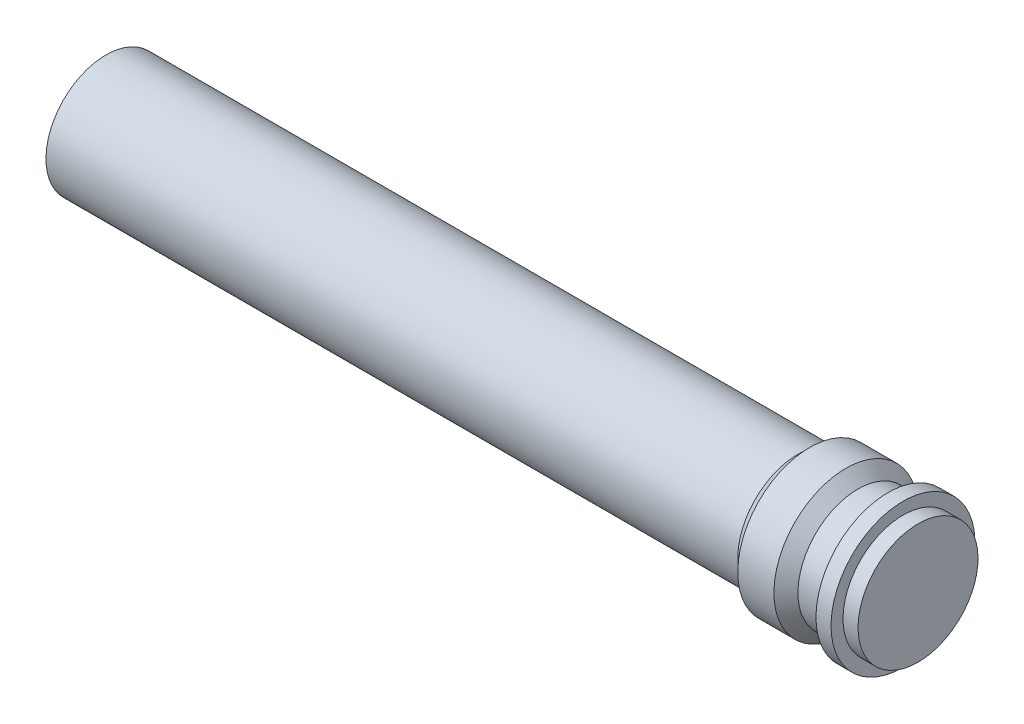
ISO-10303-21;
HEADER;
FILE_DESCRIPTION(('STEP AP214'),'2;1');
FILE_NAME('part.step','',(''),(''),'','','');
FILE_SCHEMA(('AUTOMOTIVE_DESIGN { 1 0 10303 214 1 1 1 1 }'));
ENDSEC;
DATA;
#1=APPLICATION_CONTEXT('core data for automotive mechanical design processes');
#2=APPLICATION_PROTOCOL_DEFINITION('international standard','automotive_design',2000,#1);
#3=PRODUCT_CONTEXT('',#1,'mechanical');
#4=PRODUCT('Part','Part','',(#3));
#5=PRODUCT_RELATED_PRODUCT_CATEGORY('part','',(#4));
#6=PRODUCT_DEFINITION_FORMATION('','',#4);
#7=PRODUCT_DEFINITION_CONTEXT('part definition',#1,'design');
#8=PRODUCT_DEFINITION('design','',#6,#7);
#9=PRODUCT_DEFINITION_SHAPE('','',#8);
#10=(LENGTH_UNIT() NAMED_UNIT(*) SI_UNIT(.MILLI.,.METRE.));
#11=(NAMED_UNIT(*) PLANE_ANGLE_UNIT() SI_UNIT($,.RADIAN.));
#12=(NAMED_UNIT(*) SI_UNIT($,.STERADIAN.) SOLID_ANGLE_UNIT());
#13=UNCERTAINTY_MEASURE_WITH_UNIT(LENGTH_MEASURE(1.E-05),#10,'distance_accuracy_value','');
#14=(GEOMETRIC_REPRESENTATION_CONTEXT(3) GLOBAL_UNCERTAINTY_ASSIGNED_CONTEXT((#13)) GLOBAL_UNIT_ASSIGNED_CONTEXT((#10,
#11,#12)) REPRESENTATION_CONTEXT('',''));
#15=CARTESIAN_POINT('',(0.,0.,0.));
#16=DIRECTION('',(0.,0.,1.));
#17=DIRECTION('',(1.,0.,0.));
#18=AXIS2_PLACEMENT_3D('',#15,#16,#17);
#19=CARTESIAN_POINT('',(44.,3.24999999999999,0.));
#20=DIRECTION('',(-1.,0.,0.));
#21=DIRECTION('',(0.,-1.,0.));
#22=AXIS2_PLACEMENT_3D('',#19,#20,#21);
#23=PLANE('',#22);
#24=CARTESIAN_POINT('',(44.,0.,0.));
#25=DIRECTION('',(-1.,0.,0.));
#26=DIRECTION('',(0.,-1.,0.));
#27=AXIS2_PLACEMENT_3D('',#24,#25,#26);
#28=CIRCLE('',#27,3.25);
#29=CARTESIAN_POINT('',(44.,-3.25,0.));
#30=VERTEX_POINT('',#29);
#31=EDGE_CURVE('E10',#30,#30,#28,.T.);
#32=ORIENTED_EDGE('',*,*,#31,.F.);
#33=EDGE_LOOP('',(#32));
#34=FACE_BOUND('',#33,.T.);
#35=ADVANCED_FACE('F31',(#34),#23,.F.);
#36=CARTESIAN_POINT('',(44.,0.,0.));
#37=DIRECTION('',(-1.,0.,0.));
#38=DIRECTION('',(0.,-1.,0.));
#39=AXIS2_PLACEMENT_3D('',#36,#37,#38);
#40=CYLINDRICAL_SURFACE('',#39,3.25);
#41=CARTESIAN_POINT('',(43.185185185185,0.,0.));
#42=DIRECTION('',(-1.,0.,0.));
#43=DIRECTION('',(0.,-1.,0.));
#44=AXIS2_PLACEMENT_3D('',#41,#42,#43);
#45=CIRCLE('',#44,3.25);
#46=CARTESIAN_POINT('',(43.185185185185,-3.25,0.));
#47=VERTEX_POINT('',#46);
#48=EDGE_CURVE('E37',#47,#47,#45,.T.);
#49=ORIENTED_EDGE('',*,*,#48,.F.);
#50=EDGE_LOOP('',(#49));
#51=FACE_BOUND('',#50,.T.);
#52=ORIENTED_EDGE('',*,*,#31,.T.);
#53=EDGE_LOOP('',(#52));
#54=FACE_BOUND('',#53,.T.);
#55=ADVANCED_FACE('F115',(#51,#54),#40,.T.);
#56=CARTESIAN_POINT('',(43.185185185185,3.9,0.));
#57=DIRECTION('',(-1.,0.,0.));
#58=DIRECTION('',(0.,-1.,0.));
#59=AXIS2_PLACEMENT_3D('',#56,#57,#58);
#60=PLANE('',#59);
#61=CARTESIAN_POINT('',(43.185185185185,0.,0.));
#62=DIRECTION('',(-1.,0.,0.));
#63=DIRECTION('',(0.,-1.,0.));
#64=AXIS2_PLACEMENT_3D('',#61,#62,#63);
#65=CIRCLE('',#64,3.9);
#66=CARTESIAN_POINT('',(43.185185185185,-3.9,0.));
#67=VERTEX_POINT('',#66);
#68=EDGE_CURVE('E41',#67,#67,#65,.T.);
#69=ORIENTED_EDGE('',*,*,#68,.F.);
#70=EDGE_LOOP('',(#69));
#71=FACE_BOUND('',#70,.T.);
#72=ORIENTED_EDGE('',*,*,#48,.T.);
#73=EDGE_LOOP('',(#72));
#74=FACE_BOUND('',#73,.T.);
#75=ADVANCED_FACE('F110',(#71,#74),#60,.F.);
#76=CARTESIAN_POINT('',(44.,0.,0.));
#77=DIRECTION('',(-1.,0.,0.));
#78=DIRECTION('',(0.,-1.,0.));
#79=AXIS2_PLACEMENT_3D('',#76,#77,#78);
#80=CYLINDRICAL_SURFACE('',#79,3.9);
#81=CARTESIAN_POINT('',(42.37037037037,0.,0.));
#82=DIRECTION('',(-1.,0.,0.));
#83=DIRECTION('',(0.,-1.,0.));
#84=AXIS2_PLACEMENT_3D('',#81,#82,#83);
#85=CIRCLE('',#84,3.9);
#86=CARTESIAN_POINT('',(42.37037037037,-3.9,0.));
#87=VERTEX_POINT('',#86);
#88=EDGE_CURVE('E45',#87,#87,#85,.T.);
#89=ORIENTED_EDGE('',*,*,#88,.F.);
#90=EDGE_LOOP('',(#89));
#91=FACE_BOUND('',#90,.T.);
#92=ORIENTED_EDGE('',*,*,#68,.T.);
#93=EDGE_LOOP('',(#92));
#94=FACE_BOUND('',#93,.T.);
#95=ADVANCED_FACE('F104',(#91,#94),#80,.T.);
#96=CARTESIAN_POINT('',(42.37037037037,3.24999999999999,0.));
#97=DIRECTION('',(1.,0.,0.));
#98=DIRECTION('',(0.,1.,0.));
#99=AXIS2_PLACEMENT_3D('',#96,#97,#98);
#100=PLANE('',#99);
#101=CARTESIAN_POINT('',(42.37037037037,0.,0.));
#102=DIRECTION('',(-1.,0.,0.));
#103=DIRECTION('',(0.,-1.,0.));
#104=AXIS2_PLACEMENT_3D('',#101,#102,#103);
#105=CIRCLE('',#104,3.25);
#106=CARTESIAN_POINT('',(42.37037037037,-3.25,0.));
#107=VERTEX_POINT('',#106);
#108=EDGE_CURVE('E50',#107,#107,#105,.T.);
#109=ORIENTED_EDGE('',*,*,#108,.F.);
#110=EDGE_LOOP('',(#109));
#111=FACE_BOUND('',#110,.T.);
#112=ORIENTED_EDGE('',*,*,#88,.T.);
#113=EDGE_LOOP('',(#112));
#114=FACE_BOUND('',#113,.T.);
#115=ADVANCED_FACE('F98',(#111,#114),#100,.F.);
#116=CARTESIAN_POINT('',(44.,0.,0.));
#117=DIRECTION('',(-1.,0.,0.));
#118=DIRECTION('',(0.,-1.,0.));
#119=AXIS2_PLACEMENT_3D('',#116,#117,#118);
#120=CYLINDRICAL_SURFACE('',#119,3.25);
#121=CARTESIAN_POINT('',(40.740740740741,0.,0.));
#122=DIRECTION('',(-1.,0.,0.));
#123=DIRECTION('',(0.,-1.,0.));
#124=AXIS2_PLACEMENT_3D('',#121,#122,#123);
#125=CIRCLE('',#124,3.25);
#126=CARTESIAN_POINT('',(40.740740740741,-3.25,0.));
#127=VERTEX_POINT('',#126);
#128=EDGE_CURVE('E53',#127,#127,#125,.T.);
#129=ORIENTED_EDGE('',*,*,#128,.F.);
#130=EDGE_LOOP('',(#129));
#131=FACE_BOUND('',#130,.T.);
#132=ORIENTED_EDGE('',*,*,#108,.T.);
#133=EDGE_LOOP('',(#132));
#134=FACE_BOUND('',#133,.T.);
#135=ADVANCED_FACE('F92',(#131,#134),#120,.T.);
#136=CARTESIAN_POINT('',(40.740740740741,0.,0.));
#137=DIRECTION('',(-1.,0.,0.));
#138=DIRECTION('',(0.,-1.,0.));
#139=AXIS2_PLACEMENT_3D('',#136,#137,#138);
#140=CONICAL_SURFACE('',#139,3.25,0.785398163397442);
#141=CARTESIAN_POINT('',(40.090740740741,0.,0.));
#142=DIRECTION('',(-1.,0.,0.));
#143=DIRECTION('',(0.,-1.,0.));
#144=AXIS2_PLACEMENT_3D('',#141,#142,#143);
#145=CIRCLE('',#144,3.9);
#146=CARTESIAN_POINT('',(40.090740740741,-3.9,0.));
#147=VERTEX_POINT('',#146);
#148=EDGE_CURVE('E56',#147,#147,#145,.T.);
#149=ORIENTED_EDGE('',*,*,#148,.F.);
#150=EDGE_LOOP('',(#149));
#151=FACE_BOUND('',#150,.T.);
#152=ORIENTED_EDGE('',*,*,#128,.T.);
#153=EDGE_LOOP('',(#152));
#154=FACE_BOUND('',#153,.T.);
#155=ADVANCED_FACE('F86',(#151,#154),#140,.T.);
#156=CARTESIAN_POINT('',(44.,0.,0.));
#157=DIRECTION('',(-1.,0.,0.));
#158=DIRECTION('',(0.,-1.,0.));
#159=AXIS2_PLACEMENT_3D('',#156,#157,#158);
#160=CYLINDRICAL_SURFACE('',#159,3.9);
#161=CARTESIAN_POINT('',(38.131481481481,0.,0.));
#162=DIRECTION('',(-1.,0.,0.));
#163=DIRECTION('',(0.,-1.,0.));
#164=AXIS2_PLACEMENT_3D('',#161,#162,#163);
#165=CIRCLE('',#164,3.9);
#166=CARTESIAN_POINT('',(38.131481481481,-3.9,0.));
#167=VERTEX_POINT('',#166);
#168=EDGE_CURVE('E59',#167,#167,#165,.T.);
#169=ORIENTED_EDGE('',*,*,#168,.F.);
#170=EDGE_LOOP('',(#169));
#171=FACE_BOUND('',#170,.T.);
#172=ORIENTED_EDGE('',*,*,#148,.T.);
#173=EDGE_LOOP('',(#172));
#174=FACE_BOUND('',#173,.T.);
#175=ADVANCED_FACE('F80',(#171,#174),#160,.T.);
#176=CARTESIAN_POINT('',(38.131481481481,0.,0.));
#177=DIRECTION('',(1.,0.,0.));
#178=DIRECTION('',(0.,1.,0.));
#179=AXIS2_PLACEMENT_3D('',#176,#177,#178);
#180=CONICAL_SURFACE('',#179,3.9,0.785398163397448);
#181=CARTESIAN_POINT('',(37.481481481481,0.,0.));
#182=DIRECTION('',(-1.,0.,0.));
#183=DIRECTION('',(0.,-1.,0.));
#184=AXIS2_PLACEMENT_3D('',#181,#182,#183);
#185=CIRCLE('',#184,3.25);
#186=CARTESIAN_POINT('',(37.481481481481,-3.25,0.));
#187=VERTEX_POINT('',#186);
#188=EDGE_CURVE('E62',#187,#187,#185,.T.);
#189=ORIENTED_EDGE('',*,*,#188,.F.);
#190=EDGE_LOOP('',(#189));
#191=FACE_BOUND('',#190,.T.);
#192=ORIENTED_EDGE('',*,*,#168,.T.);
#193=EDGE_LOOP('',(#192));
#194=FACE_BOUND('',#193,.T.);
#195=ADVANCED_FACE('F74',(#191,#194),#180,.T.);
#196=CARTESIAN_POINT('',(44.,0.,0.));
#197=DIRECTION('',(-1.,0.,0.));
#198=DIRECTION('',(0.,-1.,0.));
#199=AXIS2_PLACEMENT_3D('',#196,#197,#198);
#200=CYLINDRICAL_SURFACE('',#199,3.25);
#201=CARTESIAN_POINT('',(0.,0.,0.));
#202=DIRECTION('',(-1.,0.,0.));
#203=DIRECTION('',(0.,-1.,0.));
#204=AXIS2_PLACEMENT_3D('',#201,#202,#203);
#205=CIRCLE('',#204,3.24999999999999);
#206=CARTESIAN_POINT('',(0.,-3.24999999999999,0.));
#207=VERTEX_POINT('',#206);
#208=EDGE_CURVE('E65',#207,#207,#205,.T.);
#209=ORIENTED_EDGE('',*,*,#208,.F.);
#210=EDGE_LOOP('',(#209));
#211=FACE_BOUND('',#210,.T.);
#212=ORIENTED_EDGE('',*,*,#188,.T.);
#213=EDGE_LOOP('',(#212));
#214=FACE_BOUND('',#213,.T.);
#215=ADVANCED_FACE('F71',(#211,#214),#200,.T.);
#216=CARTESIAN_POINT('',(0.,0.,0.));
#217=DIRECTION('',(1.,0.,0.));
#218=DIRECTION('',(0.,1.,0.));
#219=AXIS2_PLACEMENT_3D('',#216,#217,#218);
#220=PLANE('',#219);
#221=ORIENTED_EDGE('',*,*,#208,.T.);
#222=EDGE_LOOP('',(#221));
#223=FACE_BOUND('',#222,.T.);
#224=ADVANCED_FACE('F69',(#223),#220,.F.);
#225=CLOSED_SHELL('',(#35,#55,#75,#95,#115,#135,#155,#175,#195,#215,#224));
#226=MANIFOLD_SOLID_BREP('B2',#225);
#227=ADVANCED_BREP_SHAPE_REPRESENTATION('',(#18,#226),#14);
#228=SHAPE_DEFINITION_REPRESENTATION(#9,#227);
ENDSEC;
END-ISO-10303-21;
